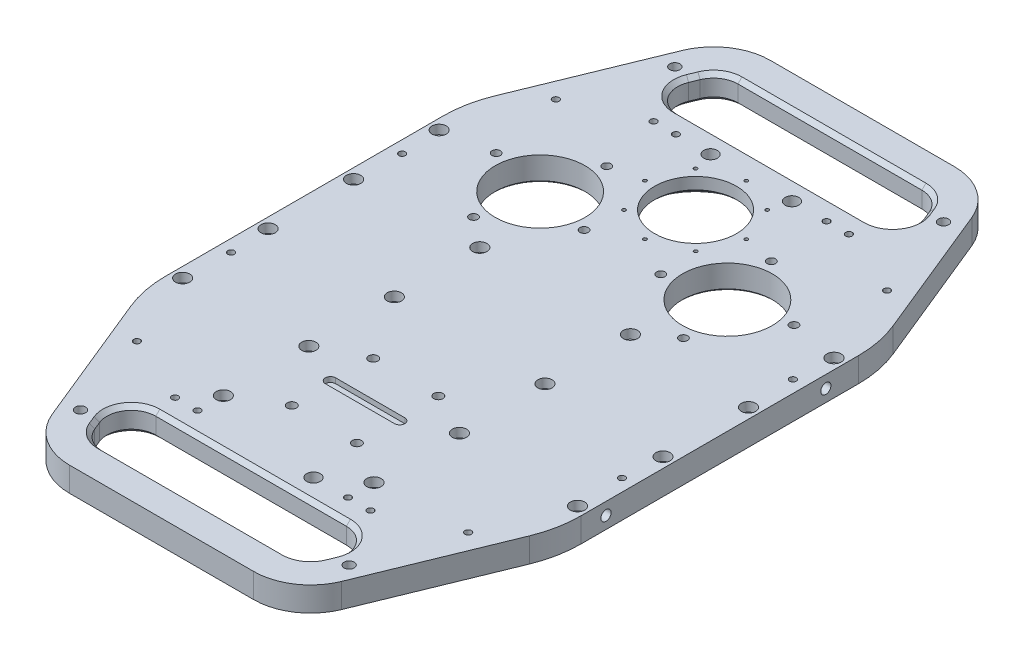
from build123d import *

# Parameters (mm, degrees)
SKETCH1_W                                        = 330.2
SKETCH1_H                                        = 400.05
BOSS_EXTRUDE1_DEPTH                              = 9.525
SKETCH2_R                                        = 35
SKETCH2_R_2                                      = 32
CUT_EXTRUDE1_DEPTH                               = 261.059441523
SKETCH3_R                                        = 44.45
CUT_EXTRUDE2_DEPTH                               = 8.35
CHAMFER1_SIZE                                    = 1.5875
CIRPATTERN1_COUNT                                = 8
SKETCH7_OUTSIDE_W                                = 436.014
SKETCH7_OUTSIDE_H                                = 505.864
CUT_EXTRUDE3_DEPTH                               = 261.059441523
SKETCH20_W                                       = 30.396158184
SKETCH20_H                                       = 139.7
BOSS_EXTRUDE3_DEPTH                              = 19.05
BOSS_EXTRUDE4_START                              = -19.05
BOSS_EXTRUDE4_DEPTH                              = 19.05
CHAMFER2_SIZE                                    = 3.175
F_1_4_20_TAPPED_HOLE1_D                          = 5.1054
CIRPATTERN2_COUNT                                = 4
CIRPATTERN3_COUNT                                = 4
CBORE_FOR_1_4_SOCKET_HEAD_CAP_SCREW1_D           = 7.14375
CBORE_FOR_1_4_SOCKET_HEAD_CAP_SCREW1_CBORE_D     = 11.1125
CBORE_FOR_1_4_SOCKET_HEAD_CAP_SCREW1_CBORE_DEPTH = 7.112
F_3_8_16_TAPPED_HOLE1_AT_2_COUNT                 = 2
F_3_8_16_TAPPED_HOLE1_AT_2_PITCH                 = 171.45
SKETCH34_W                                       = 25.4
SKETCH34_H                                       = 19.05
CUT_EXTRUDE8_DEPTH                               = 0.0254
CBORE_FOR_1_4_SOCKET_HEAD_CAP_SCREW2_D           = 7.14375
CBORE_FOR_1_4_SOCKET_HEAD_CAP_SCREW2_CBORE_D     = 11.1125
CBORE_FOR_1_4_SOCKET_HEAD_CAP_SCREW2_CBORE_DEPTH = 7.112
CBORE_FOR_1_4_SOCKET_HEAD_CAP_SCREW3_D           = 7.14375
CBORE_FOR_1_4_SOCKET_HEAD_CAP_SCREW3_CBORE_D     = 11.1125
CBORE_FOR_1_4_SOCKET_HEAD_CAP_SCREW3_CBORE_DEPTH = 7.112
CUT_EXTRUDE10_DEPTH                              = 4
F_1_4_20_TAPPED_HOLE2_D                          = 5.1054
HOLE1_D                                          = 10.65
CHAMFER3_SIZE                                    = 1.5875
HOLE2_D                                          = 6.604
HOLE2_DEPTH                                      = 9.525
HOLE2_TIP                                        = 1.984041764
SKETCH46_R                                       = 6.9125
BOSS_EXTRUDE6_DEPTH                              = 19.05
F_3_8_16_TAPPED_HOLE2_D                          = 7.9375


with BuildPart() as part:
    # Sketch1 → Boss-Extrude1 (new, symmetric)
    with BuildSketch(Plane(origin=(0, 0, 0), x_dir=(1, 0, 0), z_dir=(0, 1, 0))):
        Rectangle(SKETCH1_W, SKETCH1_H)
    extrude(amount=BOSS_EXTRUDE1_DEPTH, both=True)

    # Sketch2 → Cut-Extrude1 (cut, through all)
    with BuildSketch(Plane(origin=(0, 9.525, 0), x_dir=(1, 0, 0), z_dir=(0, 1, 0))):
        with Locations(Location((-73.025, 97.846272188, 0), (0, 0, 270))):
            Circle(SKETCH2_R)
        with Locations(Location((73.025, 97.846272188, 0), (0, 0, 270))):
            Circle(SKETCH2_R)
        with Locations(Location((0, 146.05, 0), (0, 0, 270))):
            Circle(SKETCH2_R_2)
    extrude(amount=-CUT_EXTRUDE1_DEPTH, mode=Mode.SUBTRACT)

    # Sketch3 → Cut-Extrude2 (cut)
    with BuildSketch(Plane(origin=(0, -9.525, 0), x_dir=(1, 0, 0), z_dir=(0, 1, 0))):
        with Locations(Location((0, 146.05, 0), (0, 0, 270))):
            Circle(SKETCH3_R)
    extrude(amount=CUT_EXTRUDE2_DEPTH, mode=Mode.SUBTRACT)

    # Chamfer1
    chamfer1_edges = [part.edges().sort_by_distance(p)[0] for p in [
        (-73.025, -9.525, -132.846272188),
        (73.025, -9.525, -132.846272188),
        (0, -1.175, -178.05),
    ]]
    chamfer(chamfer1_edges, length=CHAMFER1_SIZE)

    # Sketch4 → 6-32 Tapped Hole1 (revolve, cut)
    with BuildSketch(Plane(origin=(-27.930717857, -1.175, -173.980717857), x_dir=(0, 0, -1), z_dir=(1, 0, 0))):
        Polygon((0, 0), (0, 12.24269403), (1.35255, 11.43), (1.35255, 0), align=None)
    f_6_32_tapped_hole1 = revolve(axis=Axis((-27.930717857, -7.525, -173.980717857), (0, 1, 0)), mode=Mode.SUBTRACT)

    # CirPattern1: 6-32 Tapped Hole1 ×8 about axis
    cirpattern1_axis = Axis((0, 0, -146.05), (0, 1, 0))
    for i in range(1, CIRPATTERN1_COUNT):
        add(f_6_32_tapped_hole1.rotate(cirpattern1_axis, i * 360 / CIRPATTERN1_COUNT), mode=Mode.SUBTRACT)

    # Sketch7 outside → Cut-Extrude3 (cut, through all)
    with BuildSketch(Plane.XZ.offset(9.525)):
        Rectangle(SKETCH7_OUTSIDE_W, SKETCH7_OUTSIDE_H)
        with BuildLine():
            Line((-161.925, -97.846272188), (-161.925, -111.125))
            ThreePointArc((-161.925, -111.125), (-135.886792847, -173.986792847), (-73.025, -200.025))
            Line((-73.025, -200.025), (73.025, -200.025))
            ThreePointArc((73.025, -200.025), (135.886792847, -173.986792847), (161.925, -111.125))
            Line((161.925, -111.125), (161.925, -97.846272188))
            ThreePointArc((161.925, -97.846272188), (155.15789044, -63.82571505), (135.886792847, -34.98447934))
            Line((135.886792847, -34.98447934), (133.388713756, -32.486400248))
            ThreePointArc((133.388713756, -32.486400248), (131.528841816, -27.996272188), (133.388713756, -23.506144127))
            Line((133.388713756, -23.506144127), (135.886792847, -21.008065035))
            ThreePointArc((135.886792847, -21.008065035), (155.15789044, 7.833170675), (161.925, 41.853727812))
            Line((161.925, 41.853727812), (161.925, 105.353727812))
            ThreePointArc((161.925, 105.353727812), (135.886792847, 168.21552066), (73.025, 194.253727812))
            Line((73.025, 194.253727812), (-50.8, 194.253727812))
            Line((-50.8, 194.253727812), (-73.025, 194.253727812))
            ThreePointArc((-73.025, 194.253727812), (-135.886792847, 168.21552066), (-161.925, 105.353727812))
            Line((-161.925, 105.353727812), (-161.925, 41.853727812))
            ThreePointArc((-161.925, 41.853727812), (-155.15789044, 7.833170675), (-135.886792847, -21.008065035))
            Line((-135.886792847, -21.008065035), (-133.388713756, -23.506144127))
            ThreePointArc((-133.388713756, -23.506144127), (-131.528841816, -27.996272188), (-133.388713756, -32.486400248))
            Line((-133.388713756, -32.486400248), (-135.886792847, -34.98447934))
            ThreePointArc((-135.886792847, -34.98447934), (-155.15789044, -63.82571505), (-161.925, -97.846272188))
        make_face(mode=Mode.SUBTRACT)
    extrude(amount=-CUT_EXTRUDE3_DEPTH, mode=Mode.SUBTRACT)

    # Sketch20 → Boss-Extrude3 (add)
    with BuildSketch(Plane.XZ.offset(9.525)):
        with Locations((-146.726920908, -27.996272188)):
            Rectangle(SKETCH20_W, SKETCH20_H)
        with Locations((146.726920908, -27.996272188)):
            Rectangle(SKETCH20_W, SKETCH20_H)
    extrude(amount=-BOSS_EXTRUDE3_DEPTH)

    # Sketch21 → Boss-Extrude4 (add)
    with BuildSketch(Plane(origin=(0, 9.525, 0), x_dir=(1, 0, 0), z_dir=(0, 1, 0)).offset(BOSS_EXTRUDE4_START)):
        with BuildLine():
            Line((155.320288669, 144.750815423), (112.892502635, 248.587907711))
            ThreePointArc((112.892502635, 248.587907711), (96.528610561, 268.674432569), (71.7448583, 276.225))
            Line((71.7448583, 276.225), (-71.7448583, 276.225))
            ThreePointArc((-71.7448583, 276.225), (-96.528610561, 268.674432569), (-112.892502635, 248.587907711))
            Line((-112.892502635, 248.587907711), (-155.320288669, 144.750815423))
            ThreePointArc((-155.320288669, 144.750815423), (-122.592504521, 184.923865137), (-73.025, 200.025))
            Line((-73.025, 200.025), (73.025, 200.025))
            ThreePointArc((73.025, 200.025), (122.592504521, 184.923865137), (155.320288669, 144.750815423))
        make_face()
        with BuildLine():
            Line((74.33946525, 206.375), (-74.33946525, 206.375))
            ThreePointArc((-74.33946525, 206.375), (-90.153507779, 214.803391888), (-91.974169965, 232.630531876))
            Line((-91.974169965, 232.630531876), (-89.379563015, 238.980531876))
            ThreePointArc((-89.379563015, 238.980531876), (-82.366466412, 247.589042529), (-71.7448583, 250.825))
            Line((-71.7448583, 250.825), (71.7448583, 250.825))
            ThreePointArc((71.7448583, 250.825), (82.366466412, 247.589042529), (89.379563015, 238.980531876))
            Line((89.379563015, 238.980531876), (91.974169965, 232.630531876))
            ThreePointArc((91.974169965, 232.630531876), (90.153507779, 214.803391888), (74.33946525, 206.375))
        make_face(mode=Mode.SUBTRACT)
    boss_extrude4 = extrude(amount=BOSS_EXTRUDE4_DEPTH)

    # Mirror3: Boss-Extrude4 across plane
    add(boss_extrude4.mirror(Plane(origin=(0, -9.525, -2.885636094), x_dir=(1, 0, 0), z_dir=(0, 0, 1))))

    # Chamfer2
    chamfer2_edges = [part.edges().sort_by_distance(p)[0] for p in [
        (0, -9.525, -250.825),
        (0, 9.525, -250.825),
        (-82.366466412, -9.525, -247.589042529),
        (-82.366466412, 9.525, -247.589042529),
        (-90.67686649, -9.525, -235.805531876),
        (-90.67686649, 9.525, -235.805531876),
        (-90.153507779, -9.525, -214.803391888),
        (-90.153507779, 9.525, -214.803391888),
        (0, -9.525, -206.375),
        (0, 9.525, -206.375),
        (90.153507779, -9.525, -214.803391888),
        (90.153507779, 9.525, -214.803391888),
        (90.67686649, -9.525, -235.805531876),
        (90.67686649, 9.525, -235.805531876),
        (82.366466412, -9.525, -247.589042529),
        (82.366466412, 9.525, -247.589042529),
        (90.67686649, 9.525, 230.034259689),
        (82.366466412, 9.525, 241.817770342),
        (0, 9.525, 245.053727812),
        (-82.366466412, 9.525, 241.817770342),
        (-90.67686649, 9.525, 230.034259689),
        (-90.153507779, 9.525, 209.032119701),
        (0, 9.525, 200.603727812),
        (90.153507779, 9.525, 209.032119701),
        (82.366466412, -9.525, 241.817770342),
        (90.67686649, -9.525, 230.034259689),
        (90.153507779, -9.525, 209.032119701),
        (0, -9.525, 200.603727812),
        (-90.153507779, -9.525, 209.032119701),
        (-90.67686649, -9.525, 230.034259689),
        (-82.366466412, -9.525, 241.817770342),
        (0, -9.525, 245.053727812),
    ]]
    chamfer(chamfer2_edges, length=CHAMFER2_SIZE)

    # 1_4-20 Tapped Hole1 (through all)
    with Locations(Plane(origin=(0, 9.525, 0), x_dir=(1, 0, 0), z_dir=(0, 1, 0))):
        with Locations((-152.4, 69.560636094), (-129.151600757, 166.231986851), (-58.7375, 189.480386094), (-58.7375, -183.709113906), (-129.151600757, -160.460714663), (-152.4, -63.789363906), (58.7375, -183.709113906), (129.151600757, -160.460714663), (152.4, -63.789363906), (152.4, 69.560636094), (129.151600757, 166.231986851), (58.7375, 189.480386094)):
            Hole(F_1_4_20_TAPPED_HOLE1_D / 2)

    # Sketch26 → 5_16-18 Tapped Hole1 (revolve, cut)
    with BuildSketch(Plane(origin=(29.919253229, -9.525, -89.020480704), x_dir=(0, 0, -1), z_dir=(1, 0, 0))):
        Polygon((0, 0), (0, 28.859748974), (3.2639, 26.8986), (3.2639, 0), align=None)
    f_5_16_18_tapped_hole1 = revolve(axis=Axis((29.919253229, -15.875, -89.020480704), (0, 1, 0)), mode=Mode.SUBTRACT)

    # CirPattern2: 5_16-18 Tapped Hole1 ×4 about axis
    cirpattern2_axis = Axis((73.025, 0, -97.846272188), (0, 1, 0))
    for i in range(1, CIRPATTERN2_COUNT):
        add(f_5_16_18_tapped_hole1.rotate(cirpattern2_axis, i * 360 / CIRPATTERN2_COUNT), mode=Mode.SUBTRACT)

    # Sketch28 → 5_16-18 Tapped Hole2 (revolve, cut)
    with BuildSketch(Plane(origin=(-29.919253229, -9.525, -89.020480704), x_dir=(0, 0, -1), z_dir=(1, 0, 0))):
        Polygon((0, 0), (0, 28.859748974), (3.2639, 26.8986), (3.2639, 0), align=None)
    f_5_16_18_tapped_hole2 = revolve(axis=Axis((-29.919253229, -15.875, -89.020480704), (0, 1, 0)), mode=Mode.SUBTRACT)

    # CirPattern3: 5_16-18 Tapped Hole2 ×4 about axis
    cirpattern3_axis = Axis((-73.025, 0, -97.846272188), (0, 1, 0))
    for i in range(1, CIRPATTERN3_COUNT):
        add(f_5_16_18_tapped_hole2.rotate(cirpattern3_axis, i * 360 / CIRPATTERN3_COUNT), mode=Mode.SUBTRACT)

    # CBORE for 1_4 Socket Head Cap Screw1 (through all)
    with Locations(Plane(origin=(-38.113188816, 9.525, 9.245085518), x_dir=(-1, 0, 0), z_dir=(0, 1, 0))):
        with Locations((-192.100688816, 24.092414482), (-192.100688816, -42.582585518), (-192.100688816, -109.257585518), (-192.100688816, 90.767414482), (-96.850688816, 154.267414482), (-96.850688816, 87.592414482), (-96.850688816, 20.917414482), (-96.850688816, -45.757585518)):
            CounterBoreHole(CBORE_FOR_1_4_SOCKET_HEAD_CAP_SCREW1_D / 2, CBORE_FOR_1_4_SOCKET_HEAD_CAP_SCREW1_CBORE_D / 2, CBORE_FOR_1_4_SOCKET_HEAD_CAP_SCREW1_CBORE_DEPTH)

    # Sketch12 → 3_8-16 Tapped Hole1 (revolve, cut)
    with BuildSketch(Plane(origin=(161.925, 0, -85.725), x_dir=(0, 0, -1), z_dir=(0, 1, 0))):
        Polygon((0, 0), (0, 34.134665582), (3.96875, 31.75), (3.96875, 0), align=None)
    f_3_8_16_tapped_hole1 = revolve(axis=Axis((168.275, 0, -85.725), (-1, 0, 0)), mode=Mode.SUBTRACT)

    # 3_8-16 Tapped Hole1 at 2: 3_8-16 Tapped Hole1 ×2
    with Locations(*[(0, 0, i * F_3_8_16_TAPPED_HOLE1_AT_2_PITCH) for i in range(1, F_3_8_16_TAPPED_HOLE1_AT_2_COUNT)]):
        add(f_3_8_16_tapped_hole1, mode=Mode.SUBTRACT)

    # Sketch34 → Cut-Extrude8 (cut)
    with BuildSketch(Plane(origin=(-161.925, 0, 0), x_dir=(0, 0, -1), z_dir=(1, 0, 0))):
        with Locations((-85.725, 0)):
            Rectangle(SKETCH34_W, SKETCH34_H)
        with Locations((85.725, 0)):
            Rectangle(SKETCH34_W, SKETCH34_H)
    extrude(amount=CUT_EXTRUDE8_DEPTH, mode=Mode.SUBTRACT)

    # Mirror2: 3_8-16 Tapped Hole1 across plane
    add(f_3_8_16_tapped_hole1.mirror(Plane(origin=(0, 0, 0), x_dir=(0, 0, 1), z_dir=(1, 0, 0))), mode=Mode.SUBTRACT)

    # Mirror2 copy 1 sketch → Mirror2 copy 1 (revolve, cut)
    with BuildSketch(Plane(origin=(-161.925, 0, 85.725), x_dir=(0, 0, -1), z_dir=(0, 1, 0))):
        Polygon((0, 0), (0, -34.134665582), (3.96875, -31.75), (3.96875, 0), align=None)
    revolve(axis=Axis((-168.275, 0, 85.725), (-1, 0, 0)), mode=Mode.SUBTRACT)

    # CBORE for 1_4 Socket Head Cap Screw2 (through all)
    with Locations(Plane(origin=(0, -9.525, 0), x_dir=(-1, 0, 0), z_dir=(0, -1, 0))):
        with Locations((-25.4, -143.4592), (-25.4, -79.9592), (25.4, -79.9592), (25.4, -143.4592)):
            CounterBoreHole(CBORE_FOR_1_4_SOCKET_HEAD_CAP_SCREW2_D / 2, CBORE_FOR_1_4_SOCKET_HEAD_CAP_SCREW2_CBORE_D / 2, CBORE_FOR_1_4_SOCKET_HEAD_CAP_SCREW2_CBORE_DEPTH)

    # CBORE for 1_4 Socket Head Cap Screw3 (through all)
    with Locations(Plane(origin=(0, 9.525, 0), x_dir=(1, 0, 0), z_dir=(0, 1, 0))):
        with Locations((-153.9875, -100.0125), (-153.9875, -33.3375), (-153.9875, 33.3375), (-153.9875, 100.0125), (-58.7375, 36.5125), (-58.7375, -30.1625), (-58.7375, -96.8375), (-58.7375, -163.5125)):
            CounterBoreHole(CBORE_FOR_1_4_SOCKET_HEAD_CAP_SCREW3_D / 2, CBORE_FOR_1_4_SOCKET_HEAD_CAP_SCREW3_CBORE_D / 2, CBORE_FOR_1_4_SOCKET_HEAD_CAP_SCREW3_CBORE_DEPTH)

    # Sketch39 → Cut-Extrude10 (cut)
    with BuildSketch(Plane(origin=(0, 9.525, 0), x_dir=(1, 0, 0), z_dir=(0, 1, 0))):
        with BuildLine():
            Line((-26.9875, -107.7092), (26.9875, -107.7092))
            ThreePointArc((26.9875, -107.7092), (30.9875, -111.7092), (26.9875, -115.7092))
            Line((26.9875, -115.7092), (-26.9875, -115.7092))
            ThreePointArc((-26.9875, -115.7092), (-30.9875, -111.7092), (-26.9875, -107.7092))
        make_face()
    extrude(amount=-CUT_EXTRUDE10_DEPTH, mode=Mode.SUBTRACT)

    # 1_4-20 Tapped Hole2 (through all)
    with Locations(Plane(origin=(0, -9.525, 0), x_dir=(-1, 0, 0), z_dir=(0, -1, 0))):
        with Locations((76.2, -183.709113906), (-76.2, -183.709113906), (-76.2, 189.480386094), (76.2, 189.480386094)):
            Hole(F_1_4_20_TAPPED_HOLE2_D / 2)

    # Hole1 (through all)
    with Locations(Plane(origin=(0, -9.525, 0), x_dir=(-1, 0, 0), z_dir=(0, -1, 0))):
        with Locations((31.75, -183.709113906), (31.75, 189.480386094), (-31.75, 189.480386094), (-31.75, -183.709113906)):
            Hole(HOLE1_D / 2)

    # Chamfer3
    chamfer3_edges = [part.edges().sort_by_distance(p)[0] for p in [
        (26.425, -9.525, 183.709113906),
        (26.425, -9.525, -189.480386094),
        (-37.075, -9.525, -189.480386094),
        (-37.075, -9.525, 183.709113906),
    ]]
    chamfer(chamfer3_edges, length=CHAMFER3_SIZE)

    # Hole2
    with Locations(Plane(origin=(0, -9.525, 0), x_dir=(-1, 0, 0), z_dir=(0, -1, 0))):
        with Locations((76.2, -183.709113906), (-76.2, -183.709113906), (-76.2, 189.480386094), (76.2, 189.480386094)):
            Hole(HOLE2_D / 2, depth=HOLE2_DEPTH)
            with Locations((0, 0, -(HOLE2_DEPTH + HOLE2_TIP / 2))):  # 118° drill point
                Cone(0, HOLE2_D / 2, HOLE2_TIP, mode=Mode.SUBTRACT)

    # Sketch46 → Boss-Extrude6 (add)
    with BuildSketch(Plane.XZ.offset(9.525)):
        with Locations((-31.75, 183.709113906)):
            Circle(SKETCH46_R)
    extrude(amount=-BOSS_EXTRUDE6_DEPTH)

    # 3_8-16 Tapped Hole2 (through all)
    with Locations(Plane(origin=(0, 9.525, 0), x_dir=(1, 0, 0), z_dir=(0, 1, 0))):
        with Locations((-104.775, -228.889363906), (-104.775, 234.660636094), (104.775, 234.660636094), (104.775, -228.889363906)):
            Hole(F_3_8_16_TAPPED_HOLE2_D / 2)


solid = part.part
